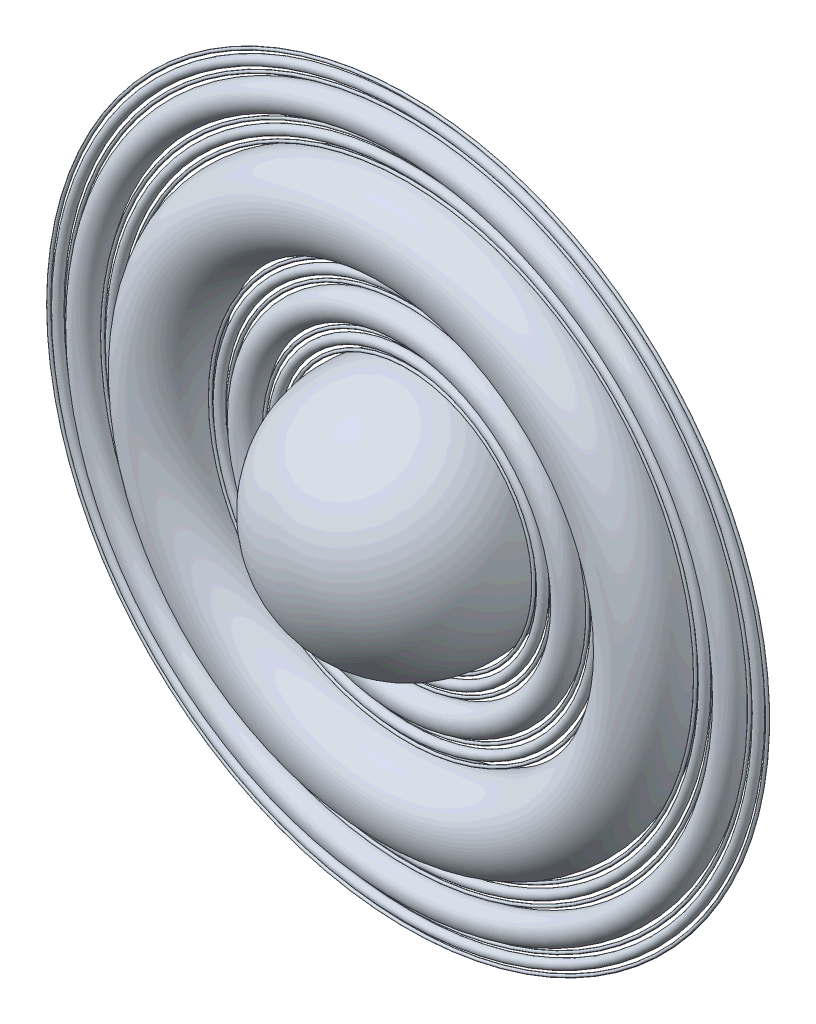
ISO-10303-21;
HEADER;
FILE_DESCRIPTION(('STEP AP214'),'2;1');
FILE_NAME('part.step','',(''),(''),'','','');
FILE_SCHEMA(('AUTOMOTIVE_DESIGN { 1 0 10303 214 1 1 1 1 }'));
ENDSEC;
DATA;
#1=APPLICATION_CONTEXT('core data for automotive mechanical design processes');
#2=APPLICATION_PROTOCOL_DEFINITION('international standard','automotive_design',2000,#1);
#3=PRODUCT_CONTEXT('',#1,'mechanical');
#4=PRODUCT('Part','Part','',(#3));
#5=PRODUCT_RELATED_PRODUCT_CATEGORY('part','',(#4));
#6=PRODUCT_DEFINITION_FORMATION('','',#4);
#7=PRODUCT_DEFINITION_CONTEXT('part definition',#1,'design');
#8=PRODUCT_DEFINITION('design','',#6,#7);
#9=PRODUCT_DEFINITION_SHAPE('','',#8);
#10=(LENGTH_UNIT() NAMED_UNIT(*) SI_UNIT(.MILLI.,.METRE.));
#11=(NAMED_UNIT(*) PLANE_ANGLE_UNIT() SI_UNIT($,.RADIAN.));
#12=(NAMED_UNIT(*) SI_UNIT($,.STERADIAN.) SOLID_ANGLE_UNIT());
#13=UNCERTAINTY_MEASURE_WITH_UNIT(LENGTH_MEASURE(1.E-05),#10,'distance_accuracy_value','');
#14=(GEOMETRIC_REPRESENTATION_CONTEXT(3) GLOBAL_UNCERTAINTY_ASSIGNED_CONTEXT((#13)) GLOBAL_UNIT_ASSIGNED_CONTEXT((#10,
#11,#12)) REPRESENTATION_CONTEXT('',''));
#15=CARTESIAN_POINT('',(0.,0.,0.));
#16=DIRECTION('',(0.,0.,1.));
#17=DIRECTION('',(1.,0.,0.));
#18=AXIS2_PLACEMENT_3D('',#15,#16,#17);
#19=CARTESIAN_POINT('',(0.,0.,0.));
#20=DIRECTION('',(0.,0.,-1.));
#21=DIRECTION('',(-1.,0.,0.));
#22=AXIS2_PLACEMENT_3D('',#19,#20,#21);
#23=TOROIDAL_SURFACE('',#22,9720.,40.5000000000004);
#24=CARTESIAN_POINT('',(-9760.5,0.,0.));
#25=VERTEX_POINT('',#24);
#26=VERTEX_LOOP('',#25);
#27=FACE_BOUND('',#26,.T.);
#28=ADVANCED_FACE('F36',(#27),#23,.T.);
#29=CLOSED_SHELL('',(#28));
#30=MANIFOLD_SOLID_BREP('B2',#29);
#31=CARTESIAN_POINT('',(0.,0.,0.));
#32=DIRECTION('',(0.,0.,-1.));
#33=DIRECTION('',(-1.,0.,0.));
#34=AXIS2_PLACEMENT_3D('',#31,#32,#33);
#35=TOROIDAL_SURFACE('',#34,9234.,40.5000000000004);
#36=CARTESIAN_POINT('',(-9274.5,0.,0.));
#37=VERTEX_POINT('',#36);
#38=VERTEX_LOOP('',#37);
#39=FACE_BOUND('',#38,.T.);
#40=ADVANCED_FACE('F55',(#39),#35,.T.);
#41=CLOSED_SHELL('',(#40));
#42=MANIFOLD_SOLID_BREP('B6',#41);
#43=CARTESIAN_POINT('',(0.,0.,0.));
#44=DIRECTION('',(0.,0.,-1.));
#45=DIRECTION('',(-1.,0.,0.));
#46=AXIS2_PLACEMENT_3D('',#43,#44,#45);
#47=TOROIDAL_SURFACE('',#46,8262.,40.5000000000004);
#48=CARTESIAN_POINT('',(-8302.5,0.,0.));
#49=VERTEX_POINT('',#48);
#50=VERTEX_LOOP('',#49);
#51=FACE_BOUND('',#50,.T.);
#52=ADVANCED_FACE('F74',(#51),#47,.T.);
#53=CLOSED_SHELL('',(#52));
#54=MANIFOLD_SOLID_BREP('B32',#53);
#55=CARTESIAN_POINT('',(0.,0.,0.));
#56=DIRECTION('',(0.,0.,-1.));
#57=DIRECTION('',(-1.,0.,0.));
#58=AXIS2_PLACEMENT_3D('',#55,#56,#57);
#59=TOROIDAL_SURFACE('',#58,7776.,40.4999999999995);
#60=CARTESIAN_POINT('',(-7816.5,0.,0.));
#61=VERTEX_POINT('',#60);
#62=VERTEX_LOOP('',#61);
#63=FACE_BOUND('',#62,.T.);
#64=ADVANCED_FACE('F93',(#63),#59,.T.);
#65=CLOSED_SHELL('',(#64));
#66=MANIFOLD_SOLID_BREP('B51',#65);
#67=CARTESIAN_POINT('',(0.,0.,0.));
#68=DIRECTION('',(0.,0.,-1.));
#69=DIRECTION('',(-1.,0.,0.));
#70=AXIS2_PLACEMENT_3D('',#67,#68,#69);
#71=TOROIDAL_SURFACE('',#70,5346.,40.4999999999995);
#72=CARTESIAN_POINT('',(-5386.5,0.,0.));
#73=VERTEX_POINT('',#72);
#74=VERTEX_LOOP('',#73);
#75=FACE_BOUND('',#74,.T.);
#76=ADVANCED_FACE('F112',(#75),#71,.T.);
#77=CLOSED_SHELL('',(#76));
#78=MANIFOLD_SOLID_BREP('B70',#77);
#79=CARTESIAN_POINT('',(0.,0.,0.));
#80=DIRECTION('',(0.,0.,-1.));
#81=DIRECTION('',(-1.,0.,0.));
#82=AXIS2_PLACEMENT_3D('',#79,#80,#81);
#83=TOROIDAL_SURFACE('',#82,4860.,40.4999999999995);
#84=CARTESIAN_POINT('',(-4900.5,0.,0.));
#85=VERTEX_POINT('',#84);
#86=VERTEX_LOOP('',#85);
#87=FACE_BOUND('',#86,.T.);
#88=ADVANCED_FACE('F131',(#87),#83,.T.);
#89=CLOSED_SHELL('',(#88));
#90=MANIFOLD_SOLID_BREP('B89',#89);
#91=CARTESIAN_POINT('',(0.,0.,0.));
#92=DIRECTION('',(0.,0.,-1.));
#93=DIRECTION('',(-1.,0.,0.));
#94=AXIS2_PLACEMENT_3D('',#91,#92,#93);
#95=TOROIDAL_SURFACE('',#94,3888.,40.5000000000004);
#96=CARTESIAN_POINT('',(-3928.5,0.,0.));
#97=VERTEX_POINT('',#96);
#98=VERTEX_LOOP('',#97);
#99=FACE_BOUND('',#98,.T.);
#100=ADVANCED_FACE('F150',(#99),#95,.T.);
#101=CLOSED_SHELL('',(#100));
#102=MANIFOLD_SOLID_BREP('B108',#101);
#103=CARTESIAN_POINT('',(0.,0.,0.));
#104=DIRECTION('',(0.,0.,-1.));
#105=DIRECTION('',(-1.,0.,0.));
#106=AXIS2_PLACEMENT_3D('',#103,#104,#105);
#107=TOROIDAL_SURFACE('',#106,3402.,40.5000000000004);
#108=CARTESIAN_POINT('',(-3442.5,0.,0.));
#109=VERTEX_POINT('',#108);
#110=VERTEX_LOOP('',#109);
#111=FACE_BOUND('',#110,.T.);
#112=ADVANCED_FACE('F169',(#111),#107,.T.);
#113=CLOSED_SHELL('',(#112));
#114=MANIFOLD_SOLID_BREP('B127',#113);
#115=CARTESIAN_POINT('',(0.,0.,0.));
#116=DIRECTION('',(0.,0.,-1.));
#117=DIRECTION('',(-1.,0.,0.));
#118=AXIS2_PLACEMENT_3D('',#115,#116,#117);
#119=TOROIDAL_SURFACE('',#118,9477.,121.499999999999);
#120=CARTESIAN_POINT('',(-9598.5,0.,0.));
#121=VERTEX_POINT('',#120);
#122=VERTEX_LOOP('',#121);
#123=FACE_BOUND('',#122,.T.);
#124=ADVANCED_FACE('F188',(#123),#119,.T.);
#125=CLOSED_SHELL('',(#124));
#126=MANIFOLD_SOLID_BREP('B146',#125);
#127=CARTESIAN_POINT('',(0.,0.,0.));
#128=DIRECTION('',(0.,0.,-1.));
#129=DIRECTION('',(-1.,0.,0.));
#130=AXIS2_PLACEMENT_3D('',#127,#128,#129);
#131=TOROIDAL_SURFACE('',#130,8019.,121.499999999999);
#132=CARTESIAN_POINT('',(-8140.5,0.,0.));
#133=VERTEX_POINT('',#132);
#134=VERTEX_LOOP('',#133);
#135=FACE_BOUND('',#134,.T.);
#136=ADVANCED_FACE('F207',(#135),#131,.T.);
#137=CLOSED_SHELL('',(#136));
#138=MANIFOLD_SOLID_BREP('B165',#137);
#139=CARTESIAN_POINT('',(0.,0.,0.));
#140=DIRECTION('',(0.,0.,-1.));
#141=DIRECTION('',(-1.,0.,0.));
#142=AXIS2_PLACEMENT_3D('',#139,#140,#141);
#143=TOROIDAL_SURFACE('',#142,5103.,121.5);
#144=CARTESIAN_POINT('',(-5224.5,0.,0.));
#145=VERTEX_POINT('',#144);
#146=VERTEX_LOOP('',#145);
#147=FACE_BOUND('',#146,.T.);
#148=ADVANCED_FACE('F226',(#147),#143,.T.);
#149=CLOSED_SHELL('',(#148));
#150=MANIFOLD_SOLID_BREP('B184',#149);
#151=CARTESIAN_POINT('',(0.,0.,0.));
#152=DIRECTION('',(0.,0.,-1.));
#153=DIRECTION('',(-1.,0.,0.));
#154=AXIS2_PLACEMENT_3D('',#151,#152,#153);
#155=TOROIDAL_SURFACE('',#154,3645.,121.5);
#156=CARTESIAN_POINT('',(-3766.5,0.,0.));
#157=VERTEX_POINT('',#156);
#158=VERTEX_LOOP('',#157);
#159=FACE_BOUND('',#158,.T.);
#160=ADVANCED_FACE('F245',(#159),#155,.T.);
#161=CLOSED_SHELL('',(#160));
#162=MANIFOLD_SOLID_BREP('B203',#161);
#163=CARTESIAN_POINT('',(0.,0.,0.));
#164=DIRECTION('',(0.,0.,-1.));
#165=DIRECTION('',(-1.,0.,0.));
#166=AXIS2_PLACEMENT_3D('',#163,#164,#165);
#167=TOROIDAL_SURFACE('',#166,8748.,364.5);
#168=CARTESIAN_POINT('',(-9112.5,0.,0.));
#169=VERTEX_POINT('',#168);
#170=VERTEX_LOOP('',#169);
#171=FACE_BOUND('',#170,.T.);
#172=ADVANCED_FACE('F264',(#171),#167,.T.);
#173=CLOSED_SHELL('',(#172));
#174=MANIFOLD_SOLID_BREP('B222',#173);
#175=CARTESIAN_POINT('',(0.,0.,0.));
#176=DIRECTION('',(0.,0.,-1.));
#177=DIRECTION('',(-1.,0.,0.));
#178=AXIS2_PLACEMENT_3D('',#175,#176,#177);
#179=TOROIDAL_SURFACE('',#178,4374.,364.500000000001);
#180=CARTESIAN_POINT('',(-4738.5,0.,0.));
#181=VERTEX_POINT('',#180);
#182=VERTEX_LOOP('',#181);
#183=FACE_BOUND('',#182,.T.);
#184=ADVANCED_FACE('F283',(#183),#179,.T.);
#185=CLOSED_SHELL('',(#184));
#186=MANIFOLD_SOLID_BREP('B241',#185);
#187=CARTESIAN_POINT('',(0.,0.,0.));
#188=DIRECTION('',(0.,0.,1.));
#189=DIRECTION('',(1.,0.,0.));
#190=AXIS2_PLACEMENT_3D('',#187,#188,#189);
#191=TOROIDAL_SURFACE('',#190,6561.,1093.5);
#192=CARTESIAN_POINT('',(7654.5,0.,0.));
#193=VERTEX_POINT('',#192);
#194=VERTEX_LOOP('',#193);
#195=FACE_BOUND('',#194,.T.);
#196=ADVANCED_FACE('F301',(#195),#191,.T.);
#197=CLOSED_SHELL('',(#196));
#198=MANIFOLD_SOLID_BREP('B260',#197);
#199=CARTESIAN_POINT('',(0.,0.,0.));
#200=DIRECTION('',(1.,0.,0.));
#201=DIRECTION('',(0.,-1.,0.));
#202=AXIS2_PLACEMENT_3D('',#199,#200,#201);
#203=SPHERICAL_SURFACE('',#202,3280.5);
#204=CARTESIAN_POINT('',(3280.5,0.,0.));
#205=VERTEX_POINT('',#204);
#206=VERTEX_LOOP('',#205);
#207=FACE_BOUND('',#206,.T.);
#208=ADVANCED_FACE('F314',(#207),#203,.T.);
#209=CLOSED_SHELL('',(#208));
#210=MANIFOLD_SOLID_BREP('B279',#209);
#211=ADVANCED_BREP_SHAPE_REPRESENTATION('',(#18,#30,#42,#54,#66,#78,#90,#102,#114,#126,#138,
#150,#162,#174,#186,#198,#210),#14);
#212=SHAPE_DEFINITION_REPRESENTATION(#9,#211);
ENDSEC;
END-ISO-10303-21;
